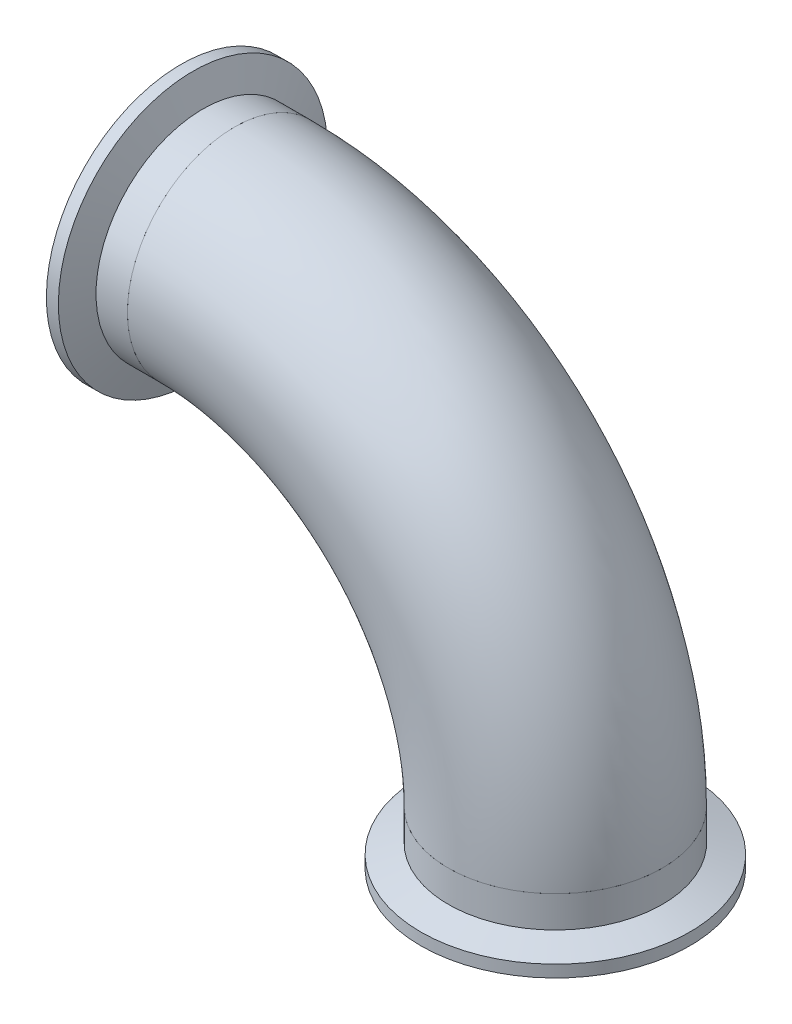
ISO-10303-21;
HEADER;
FILE_DESCRIPTION(('STEP AP214'),'2;1');
FILE_NAME('part.step','',(''),(''),'','','');
FILE_SCHEMA(('AUTOMOTIVE_DESIGN { 1 0 10303 214 1 1 1 1 }'));
ENDSEC;
DATA;
#1=APPLICATION_CONTEXT('core data for automotive mechanical design processes');
#2=APPLICATION_PROTOCOL_DEFINITION('international standard','automotive_design',2000,#1);
#3=PRODUCT_CONTEXT('',#1,'mechanical');
#4=PRODUCT('Part','Part','',(#3));
#5=PRODUCT_RELATED_PRODUCT_CATEGORY('part','',(#4));
#6=PRODUCT_DEFINITION_FORMATION('','',#4);
#7=PRODUCT_DEFINITION_CONTEXT('part definition',#1,'design');
#8=PRODUCT_DEFINITION('design','',#6,#7);
#9=PRODUCT_DEFINITION_SHAPE('','',#8);
#10=(LENGTH_UNIT() NAMED_UNIT(*) SI_UNIT(.MILLI.,.METRE.));
#11=(NAMED_UNIT(*) PLANE_ANGLE_UNIT() SI_UNIT($,.RADIAN.));
#12=(NAMED_UNIT(*) SI_UNIT($,.STERADIAN.) SOLID_ANGLE_UNIT());
#13=UNCERTAINTY_MEASURE_WITH_UNIT(LENGTH_MEASURE(1.E-05),#10,'distance_accuracy_value','');
#14=(GEOMETRIC_REPRESENTATION_CONTEXT(3) GLOBAL_UNCERTAINTY_ASSIGNED_CONTEXT((#13)) GLOBAL_UNIT_ASSIGNED_CONTEXT((#10,
#11,#12)) REPRESENTATION_CONTEXT('',''));
#15=CARTESIAN_POINT('',(0.,0.,0.));
#16=DIRECTION('',(0.,0.,1.));
#17=DIRECTION('',(1.,0.,0.));
#18=AXIS2_PLACEMENT_3D('',#15,#16,#17);
#19=CARTESIAN_POINT('',(-7.547417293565,109.721359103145,108.527403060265));
#20=DIRECTION('',(1.,0.,0.));
#21=DIRECTION('',(0.,-0.74812253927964,0.663560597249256));
#22=AXIS2_PLACEMENT_3D('',#19,#20,#21);
#23=PLANE('',#22);
#24=CARTESIAN_POINT('',(-7.547417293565,109.721359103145,108.527403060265));
#25=DIRECTION('',(-1.,0.,0.));
#26=DIRECTION('',(0.,0.74812253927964,-0.663560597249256));
#27=AXIS2_PLACEMENT_3D('',#24,#25,#26);
#28=CIRCLE('',#27,30.1591722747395);
#29=CARTESIAN_POINT('',(-7.54741729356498,132.284115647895,88.5149646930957));
#30=VERTEX_POINT('',#29);
#31=EDGE_CURVE('P0_E9',#30,#30,#28,.T.);
#32=ORIENTED_EDGE('',*,*,#31,.F.);
#33=EDGE_LOOP('',(#32));
#34=FACE_BOUND('',#33,.T.);
#35=CARTESIAN_POINT('',(-7.547417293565,109.721359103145,108.527403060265));
#36=DIRECTION('',(-1.,0.,0.));
#37=DIRECTION('',(0.,0.74812253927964,-0.663560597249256));
#38=AXIS2_PLACEMENT_3D('',#35,#36,#37);
#39=CIRCLE('',#38,31.9532);
#40=CARTESIAN_POINT('',(-7.54741729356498,133.626268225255,87.3245185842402));
#41=VERTEX_POINT('',#40);
#42=EDGE_CURVE('P0_E54',#41,#41,#39,.T.);
#43=ORIENTED_EDGE('',*,*,#42,.T.);
#44=EDGE_LOOP('',(#43));
#45=FACE_BOUND('',#44,.T.);
#46=ADVANCED_FACE('P0_F14',(#34,#45),#23,.F.);
#47=CARTESIAN_POINT('',(-6.760017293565,109.721359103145,108.527403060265));
#48=DIRECTION('',(-1.,0.,0.));
#49=DIRECTION('',(0.,0.74812253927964,-0.663560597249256));
#50=AXIS2_PLACEMENT_3D('',#47,#48,#49);
#51=TOROIDAL_SURFACE('',#50,30.1591722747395,0.7874);
#52=CARTESIAN_POINT('',(-7.06767898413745,109.721359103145,108.527403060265));
#53=DIRECTION('',(-1.,0.,0.));
#54=DIRECTION('',(0.,0.74812253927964,-0.663560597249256));
#55=AXIS2_PLACEMENT_3D('',#52,#53,#54);
#56=CIRCLE('',#55,29.4343667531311);
#57=CARTESIAN_POINT('',(-7.06767898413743,131.741872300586,88.9959170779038));
#58=VERTEX_POINT('',#57);
#59=EDGE_CURVE('P0_E20',#58,#58,#56,.T.);
#60=ORIENTED_EDGE('',*,*,#59,.F.);
#61=EDGE_LOOP('',(#60));
#62=FACE_BOUND('',#61,.T.);
#63=ORIENTED_EDGE('',*,*,#31,.T.);
#64=EDGE_LOOP('',(#63));
#65=FACE_BOUND('',#64,.T.);
#66=ADVANCED_FACE('P0_F96',(#62,#65),#51,.T.);
#67=CARTESIAN_POINT('',(-6.67456247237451,109.721359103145,108.527403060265));
#68=DIRECTION('',(-1.,0.,0.));
#69=DIRECTION('',(0.,0.74812253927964,-0.663560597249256));
#70=AXIS2_PLACEMENT_3D('',#67,#68,#69);
#71=CONICAL_SURFACE('',#70,29.2674986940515,0.401425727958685);
#72=ORIENTED_EDGE('',*,*,#59,.T.);
#73=EDGE_LOOP('',(#72));
#74=FACE_BOUND('',#73,.T.);
#75=CARTESIAN_POINT('',(-6.67456247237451,109.721359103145,108.527403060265));
#76=DIRECTION('',(-1.,0.,0.));
#77=DIRECTION('',(0.,0.74812253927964,-0.663560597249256));
#78=AXIS2_PLACEMENT_3D('',#75,#76,#77);
#79=CIRCLE('',#78,29.2674986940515);
#80=CARTESIAN_POINT('',(-6.67456247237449,131.617034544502,89.1066441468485));
#81=VERTEX_POINT('',#80);
#82=EDGE_CURVE('P0_E24',#81,#81,#79,.T.);
#83=ORIENTED_EDGE('',*,*,#82,.F.);
#84=EDGE_LOOP('',(#83));
#85=FACE_BOUND('',#84,.T.);
#86=ADVANCED_FACE('P0_F101',(#74,#85),#71,.F.);
#87=CARTESIAN_POINT('',(-7.14101729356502,109.721359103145,108.527403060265));
#88=DIRECTION('',(-1.,0.,0.));
#89=DIRECTION('',(0.,0.74812253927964,-0.663560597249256));
#90=AXIS2_PLACEMENT_3D('',#87,#88,#89);
#91=TOROIDAL_SURFACE('',#90,28.1686,1.1938);
#92=CARTESIAN_POINT('',(-6.67456247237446,109.721359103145,108.527403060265));
#93=DIRECTION('',(-1.,0.,0.));
#94=DIRECTION('',(0.,0.74812253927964,-0.663560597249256));
#95=AXIS2_PLACEMENT_3D('',#92,#93,#94);
#96=CIRCLE('',#95,27.0697013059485);
#97=CARTESIAN_POINT('',(-6.67456247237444,129.972812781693,90.565015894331));
#98=VERTEX_POINT('',#97);
#99=EDGE_CURVE('P0_E28',#98,#98,#96,.T.);
#100=ORIENTED_EDGE('',*,*,#99,.F.);
#101=EDGE_LOOP('',(#100));
#102=FACE_BOUND('',#101,.T.);
#103=ORIENTED_EDGE('',*,*,#82,.T.);
#104=EDGE_LOOP('',(#103));
#105=FACE_BOUND('',#104,.T.);
#106=ADVANCED_FACE('P0_F106',(#102,#105),#91,.F.);
#107=CARTESIAN_POINT('',(-6.67456247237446,109.721359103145,108.527403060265));
#108=DIRECTION('',(1.,0.,0.));
#109=DIRECTION('',(0.,-0.74812253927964,0.663560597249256));
#110=AXIS2_PLACEMENT_3D('',#107,#108,#109);
#111=CONICAL_SURFACE('',#110,27.0697013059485,0.401425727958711);
#112=CARTESIAN_POINT('',(-7.06767898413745,109.721359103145,108.527403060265));
#113=DIRECTION('',(-1.,0.,0.));
#114=DIRECTION('',(0.,0.74812253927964,-0.663560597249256));
#115=AXIS2_PLACEMENT_3D('',#112,#113,#114);
#116=CIRCLE('',#115,26.9028332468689);
#117=CARTESIAN_POINT('',(-7.06767898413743,129.847975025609,90.6757429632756));
#118=VERTEX_POINT('',#117);
#119=EDGE_CURVE('P0_E33',#118,#118,#116,.T.);
#120=ORIENTED_EDGE('',*,*,#119,.F.);
#121=EDGE_LOOP('',(#120));
#122=FACE_BOUND('',#121,.T.);
#123=ORIENTED_EDGE('',*,*,#99,.T.);
#124=EDGE_LOOP('',(#123));
#125=FACE_BOUND('',#124,.T.);
#126=ADVANCED_FACE('P0_F111',(#122,#125),#111,.T.);
#127=CARTESIAN_POINT('',(-6.760017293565,109.721359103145,108.527403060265));
#128=DIRECTION('',(-1.,0.,0.));
#129=DIRECTION('',(0.,0.74812253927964,-0.663560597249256));
#130=AXIS2_PLACEMENT_3D('',#127,#128,#129);
#131=TOROIDAL_SURFACE('',#130,26.1780277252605,0.787399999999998);
#132=ORIENTED_EDGE('',*,*,#119,.T.);
#133=EDGE_LOOP('',(#132));
#134=FACE_BOUND('',#133,.T.);
#135=CARTESIAN_POINT('',(-7.547417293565,109.721359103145,108.527403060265));
#136=DIRECTION('',(-1.,0.,0.));
#137=DIRECTION('',(0.,0.74812253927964,-0.663560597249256));
#138=AXIS2_PLACEMENT_3D('',#135,#136,#137);
#139=CIRCLE('',#138,26.1780277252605);
#140=CARTESIAN_POINT('',(-7.54741729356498,129.3057316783,91.1566953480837));
#141=VERTEX_POINT('',#140);
#142=EDGE_CURVE('P0_E36',#141,#141,#139,.T.);
#143=ORIENTED_EDGE('',*,*,#142,.F.);
#144=EDGE_LOOP('',(#143));
#145=FACE_BOUND('',#144,.T.);
#146=ADVANCED_FACE('P0_F92',(#134,#145),#131,.T.);
#147=CARTESIAN_POINT('',(-7.547417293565,109.721359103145,108.527403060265));
#148=DIRECTION('',(1.,0.,0.));
#149=DIRECTION('',(0.,-0.74812253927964,0.663560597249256));
#150=AXIS2_PLACEMENT_3D('',#147,#148,#149);
#151=PLANE('',#150);
#152=CARTESIAN_POINT('',(-7.547417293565,109.721359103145,108.527403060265));
#153=DIRECTION('',(-1.,0.,0.));
#154=DIRECTION('',(0.,0.74812253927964,-0.663560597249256));
#155=AXIS2_PLACEMENT_3D('',#152,#153,#154);
#156=CIRCLE('',#155,23.749);
#157=CARTESIAN_POINT('',(-7.54741729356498,127.488521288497,92.7685024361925));
#158=VERTEX_POINT('',#157);
#159=EDGE_CURVE('P0_E39',#158,#158,#156,.T.);
#160=ORIENTED_EDGE('',*,*,#159,.F.);
#161=EDGE_LOOP('',(#160));
#162=FACE_BOUND('',#161,.T.);
#163=ORIENTED_EDGE('',*,*,#142,.T.);
#164=EDGE_LOOP('',(#163));
#165=FACE_BOUND('',#164,.T.);
#166=ADVANCED_FACE('P0_F85',(#162,#165),#151,.F.);
#167=CARTESIAN_POINT('',(-7.547417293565,109.721359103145,108.527403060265));
#168=DIRECTION('',(-1.,0.,0.));
#169=DIRECTION('',(0.,0.74812253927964,-0.663560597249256));
#170=AXIS2_PLACEMENT_3D('',#167,#168,#169);
#171=CYLINDRICAL_SURFACE('',#170,23.749);
#172=ORIENTED_EDGE('',*,*,#159,.T.);
#173=EDGE_LOOP('',(#172));
#174=FACE_BOUND('',#173,.T.);
#175=CARTESIAN_POINT('',(5.15258270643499,109.721359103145,108.527403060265));
#176=DIRECTION('',(-1.,0.,0.));
#177=DIRECTION('',(0.,0.74812253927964,-0.663560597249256));
#178=AXIS2_PLACEMENT_3D('',#175,#176,#177);
#179=CIRCLE('',#178,23.749);
#180=CARTESIAN_POINT('',(5.15258270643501,127.488521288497,92.7685024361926));
#181=VERTEX_POINT('',#180);
#182=EDGE_CURVE('P0_E42',#181,#181,#179,.T.);
#183=ORIENTED_EDGE('',*,*,#182,.F.);
#184=EDGE_LOOP('',(#183));
#185=FACE_BOUND('',#184,.T.);
#186=ADVANCED_FACE('P0_F80',(#174,#185),#171,.F.);
#187=CARTESIAN_POINT('',(5.15258270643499,109.721359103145,108.527403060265));
#188=DIRECTION('',(-1.,0.,0.));
#189=DIRECTION('',(0.,0.74812253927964,-0.663560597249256));
#190=AXIS2_PLACEMENT_3D('',#187,#188,#189);
#191=PLANE('',#190);
#192=CARTESIAN_POINT('',(5.15258270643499,109.721359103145,108.527403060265));
#193=DIRECTION('',(-1.,0.,0.));
#194=DIRECTION('',(0.,0.74812253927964,-0.663560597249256));
#195=AXIS2_PLACEMENT_3D('',#192,#193,#194);
#196=CIRCLE('',#195,25.4);
#197=CARTESIAN_POINT('',(5.15258270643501,128.723671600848,91.6729638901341));
#198=VERTEX_POINT('',#197);
#199=EDGE_CURVE('P0_E45',#198,#198,#196,.T.);
#200=ORIENTED_EDGE('',*,*,#199,.F.);
#201=EDGE_LOOP('',(#200));
#202=FACE_BOUND('',#201,.T.);
#203=ORIENTED_EDGE('',*,*,#182,.T.);
#204=EDGE_LOOP('',(#203));
#205=FACE_BOUND('',#204,.T.);
#206=ADVANCED_FACE('P0_F74',(#202,#205),#191,.F.);
#207=CARTESIAN_POINT('',(-7.547417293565,109.721359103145,108.527403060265));
#208=DIRECTION('',(-1.,0.,0.));
#209=DIRECTION('',(0.,0.74812253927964,-0.663560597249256));
#210=AXIS2_PLACEMENT_3D('',#207,#208,#209);
#211=CYLINDRICAL_SURFACE('',#210,25.4);
#212=CARTESIAN_POINT('',(-2.31744755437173,109.721359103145,108.527403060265));
#213=DIRECTION('',(-1.,0.,0.));
#214=DIRECTION('',(0.,0.74812253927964,-0.663560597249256));
#215=AXIS2_PLACEMENT_3D('',#212,#213,#214);
#216=CIRCLE('',#215,25.4);
#217=CARTESIAN_POINT('',(-2.31744755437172,128.723671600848,91.6729638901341));
#218=VERTEX_POINT('',#217);
#219=EDGE_CURVE('P0_E48',#218,#218,#216,.T.);
#220=ORIENTED_EDGE('',*,*,#219,.F.);
#221=EDGE_LOOP('',(#220));
#222=FACE_BOUND('',#221,.T.);
#223=ORIENTED_EDGE('',*,*,#199,.T.);
#224=EDGE_LOOP('',(#223));
#225=FACE_BOUND('',#224,.T.);
#226=ADVANCED_FACE('P0_F68',(#222,#225),#211,.T.);
#227=CARTESIAN_POINT('',(-2.31744755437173,109.721359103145,108.527403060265));
#228=DIRECTION('',(-1.,0.,0.));
#229=DIRECTION('',(0.,0.74812253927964,-0.663560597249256));
#230=AXIS2_PLACEMENT_3D('',#227,#228,#229);
#231=CONICAL_SURFACE('',#230,25.4,1.22173047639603);
#232=CARTESIAN_POINT('',(-4.70261729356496,109.721359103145,108.527403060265));
#233=DIRECTION('',(-1.,0.,0.));
#234=DIRECTION('',(0.,0.74812253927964,-0.663560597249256));
#235=AXIS2_PLACEMENT_3D('',#232,#233,#234);
#236=CIRCLE('',#235,31.9532);
#237=CARTESIAN_POINT('',(-4.70261729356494,133.626268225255,87.3245185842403));
#238=VERTEX_POINT('',#237);
#239=EDGE_CURVE('P0_E51',#238,#238,#236,.T.);
#240=ORIENTED_EDGE('',*,*,#239,.F.);
#241=EDGE_LOOP('',(#240));
#242=FACE_BOUND('',#241,.T.);
#243=ORIENTED_EDGE('',*,*,#219,.T.);
#244=EDGE_LOOP('',(#243));
#245=FACE_BOUND('',#244,.T.);
#246=ADVANCED_FACE('P0_F62',(#242,#245),#231,.T.);
#247=CARTESIAN_POINT('',(-7.547417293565,109.721359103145,108.527403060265));
#248=DIRECTION('',(-1.,0.,0.));
#249=DIRECTION('',(0.,0.74812253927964,-0.663560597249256));
#250=AXIS2_PLACEMENT_3D('',#247,#248,#249);
#251=CYLINDRICAL_SURFACE('',#250,31.9532);
#252=ORIENTED_EDGE('',*,*,#42,.F.);
#253=EDGE_LOOP('',(#252));
#254=FACE_BOUND('',#253,.T.);
#255=ORIENTED_EDGE('',*,*,#239,.T.);
#256=EDGE_LOOP('',(#255));
#257=FACE_BOUND('',#256,.T.);
#258=ADVANCED_FACE('P0_F59',(#254,#257),#251,.T.);
#259=CLOSED_SHELL('',(#46,#66,#86,#106,#126,#146,#166,#186,#206,#226,#246,#258));
#260=MANIFOLD_SOLID_BREP('P0_B1',#259);
#261=CARTESIAN_POINT('',(81.3525827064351,20.8213591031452,108.527403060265));
#262=DIRECTION('',(0.,1.,0.));
#263=DIRECTION('',(0.,0.,1.));
#264=AXIS2_PLACEMENT_3D('',#261,#262,#263);
#265=PLANE('',#264);
#266=CARTESIAN_POINT('',(81.3525827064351,20.8213591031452,108.527403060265));
#267=DIRECTION('',(0.,-1.,0.));
#268=DIRECTION('',(0.,0.,-1.));
#269=AXIS2_PLACEMENT_3D('',#266,#267,#268);
#270=CIRCLE('',#269,30.1591722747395);
#271=CARTESIAN_POINT('',(81.3525827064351,20.8213591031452,78.3682307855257));
#272=VERTEX_POINT('',#271);
#273=EDGE_CURVE('P1_E10',#272,#272,#270,.T.);
#274=ORIENTED_EDGE('',*,*,#273,.F.);
#275=EDGE_LOOP('',(#274));
#276=FACE_BOUND('',#275,.T.);
#277=CARTESIAN_POINT('',(81.3525827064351,20.8213591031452,108.527403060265));
#278=DIRECTION('',(0.,-1.,0.));
#279=DIRECTION('',(0.,0.,-1.));
#280=AXIS2_PLACEMENT_3D('',#277,#278,#279);
#281=CIRCLE('',#280,31.9532);
#282=CARTESIAN_POINT('',(81.3525827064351,20.8213591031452,76.5742030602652));
#283=VERTEX_POINT('',#282);
#284=EDGE_CURVE('P1_E55',#283,#283,#281,.T.);
#285=ORIENTED_EDGE('',*,*,#284,.T.);
#286=EDGE_LOOP('',(#285));
#287=FACE_BOUND('',#286,.T.);
#288=ADVANCED_FACE('P1_F15',(#276,#287),#265,.F.);
#289=CARTESIAN_POINT('',(81.3525827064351,21.6087591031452,108.527403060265));
#290=DIRECTION('',(0.,-1.,0.));
#291=DIRECTION('',(0.,0.,-1.));
#292=AXIS2_PLACEMENT_3D('',#289,#290,#291);
#293=TOROIDAL_SURFACE('',#292,30.1591722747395,0.7874);
#294=CARTESIAN_POINT('',(81.3525827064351,21.3010974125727,108.527403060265));
#295=DIRECTION('',(0.,-1.,0.));
#296=DIRECTION('',(0.,0.,-1.));
#297=AXIS2_PLACEMENT_3D('',#294,#295,#296);
#298=CIRCLE('',#297,29.4343667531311);
#299=CARTESIAN_POINT('',(81.3525827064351,21.3010974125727,79.0930363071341));
#300=VERTEX_POINT('',#299);
#301=EDGE_CURVE('P1_E21',#300,#300,#298,.T.);
#302=ORIENTED_EDGE('',*,*,#301,.F.);
#303=EDGE_LOOP('',(#302));
#304=FACE_BOUND('',#303,.T.);
#305=ORIENTED_EDGE('',*,*,#273,.T.);
#306=EDGE_LOOP('',(#305));
#307=FACE_BOUND('',#306,.T.);
#308=ADVANCED_FACE('P1_F97',(#304,#307),#293,.T.);
#309=CARTESIAN_POINT('',(81.3525827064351,21.6942139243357,108.527403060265));
#310=DIRECTION('',(0.,-1.,0.));
#311=DIRECTION('',(0.,0.,-1.));
#312=AXIS2_PLACEMENT_3D('',#309,#310,#311);
#313=CONICAL_SURFACE('',#312,29.2674986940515,0.401425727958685);
#314=ORIENTED_EDGE('',*,*,#301,.T.);
#315=EDGE_LOOP('',(#314));
#316=FACE_BOUND('',#315,.T.);
#317=CARTESIAN_POINT('',(81.3525827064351,21.6942139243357,108.527403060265));
#318=DIRECTION('',(0.,-1.,0.));
#319=DIRECTION('',(0.,0.,-1.));
#320=AXIS2_PLACEMENT_3D('',#317,#318,#319);
#321=CIRCLE('',#320,29.2674986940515);
#322=CARTESIAN_POINT('',(81.3525827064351,21.6942139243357,79.2599043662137));
#323=VERTEX_POINT('',#322);
#324=EDGE_CURVE('P1_E25',#323,#323,#321,.T.);
#325=ORIENTED_EDGE('',*,*,#324,.F.);
#326=EDGE_LOOP('',(#325));
#327=FACE_BOUND('',#326,.T.);
#328=ADVANCED_FACE('P1_F102',(#316,#327),#313,.F.);
#329=CARTESIAN_POINT('',(81.3525827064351,21.2277591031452,108.527403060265));
#330=DIRECTION('',(0.,-1.,0.));
#331=DIRECTION('',(0.,0.,-1.));
#332=AXIS2_PLACEMENT_3D('',#329,#330,#331);
#333=TOROIDAL_SURFACE('',#332,28.1686,1.1938);
#334=CARTESIAN_POINT('',(81.3525827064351,21.6942139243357,108.527403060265));
#335=DIRECTION('',(0.,-1.,0.));
#336=DIRECTION('',(0.,0.,-1.));
#337=AXIS2_PLACEMENT_3D('',#334,#335,#336);
#338=CIRCLE('',#337,27.0697013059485);
#339=CARTESIAN_POINT('',(81.3525827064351,21.6942139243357,81.4577017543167));
#340=VERTEX_POINT('',#339);
#341=EDGE_CURVE('P1_E29',#340,#340,#338,.T.);
#342=ORIENTED_EDGE('',*,*,#341,.F.);
#343=EDGE_LOOP('',(#342));
#344=FACE_BOUND('',#343,.T.);
#345=ORIENTED_EDGE('',*,*,#324,.T.);
#346=EDGE_LOOP('',(#345));
#347=FACE_BOUND('',#346,.T.);
#348=ADVANCED_FACE('P1_F107',(#344,#347),#333,.F.);
#349=CARTESIAN_POINT('',(81.3525827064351,21.6942139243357,108.527403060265));
#350=DIRECTION('',(0.,1.,0.));
#351=DIRECTION('',(0.,0.,1.));
#352=AXIS2_PLACEMENT_3D('',#349,#350,#351);
#353=CONICAL_SURFACE('',#352,27.0697013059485,0.401425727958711);
#354=CARTESIAN_POINT('',(81.3525827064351,21.3010974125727,108.527403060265));
#355=DIRECTION('',(0.,-1.,0.));
#356=DIRECTION('',(0.,0.,-1.));
#357=AXIS2_PLACEMENT_3D('',#354,#355,#356);
#358=CIRCLE('',#357,26.9028332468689);
#359=CARTESIAN_POINT('',(81.3525827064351,21.3010974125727,81.6245698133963));
#360=VERTEX_POINT('',#359);
#361=EDGE_CURVE('P1_E34',#360,#360,#358,.T.);
#362=ORIENTED_EDGE('',*,*,#361,.F.);
#363=EDGE_LOOP('',(#362));
#364=FACE_BOUND('',#363,.T.);
#365=ORIENTED_EDGE('',*,*,#341,.T.);
#366=EDGE_LOOP('',(#365));
#367=FACE_BOUND('',#366,.T.);
#368=ADVANCED_FACE('P1_F112',(#364,#367),#353,.T.);
#369=CARTESIAN_POINT('',(81.3525827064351,21.6087591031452,108.527403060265));
#370=DIRECTION('',(0.,-1.,0.));
#371=DIRECTION('',(0.,0.,-1.));
#372=AXIS2_PLACEMENT_3D('',#369,#370,#371);
#373=TOROIDAL_SURFACE('',#372,26.1780277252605,0.787399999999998);
#374=ORIENTED_EDGE('',*,*,#361,.T.);
#375=EDGE_LOOP('',(#374));
#376=FACE_BOUND('',#375,.T.);
#377=CARTESIAN_POINT('',(81.3525827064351,20.8213591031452,108.527403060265));
#378=DIRECTION('',(0.,-1.,0.));
#379=DIRECTION('',(0.,0.,-1.));
#380=AXIS2_PLACEMENT_3D('',#377,#378,#379);
#381=CIRCLE('',#380,26.1780277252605);
#382=CARTESIAN_POINT('',(81.3525827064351,20.8213591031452,82.3493753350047));
#383=VERTEX_POINT('',#382);
#384=EDGE_CURVE('P1_E37',#383,#383,#381,.T.);
#385=ORIENTED_EDGE('',*,*,#384,.F.);
#386=EDGE_LOOP('',(#385));
#387=FACE_BOUND('',#386,.T.);
#388=ADVANCED_FACE('P1_F93',(#376,#387),#373,.T.);
#389=CARTESIAN_POINT('',(81.3525827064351,20.8213591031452,108.527403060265));
#390=DIRECTION('',(0.,1.,0.));
#391=DIRECTION('',(0.,0.,1.));
#392=AXIS2_PLACEMENT_3D('',#389,#390,#391);
#393=PLANE('',#392);
#394=CARTESIAN_POINT('',(81.3525827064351,20.8213591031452,108.527403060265));
#395=DIRECTION('',(0.,-1.,0.));
#396=DIRECTION('',(0.,0.,-1.));
#397=AXIS2_PLACEMENT_3D('',#394,#395,#396);
#398=CIRCLE('',#397,23.749);
#399=CARTESIAN_POINT('',(81.3525827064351,20.8213591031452,84.7784030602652));
#400=VERTEX_POINT('',#399);
#401=EDGE_CURVE('P1_E40',#400,#400,#398,.T.);
#402=ORIENTED_EDGE('',*,*,#401,.F.);
#403=EDGE_LOOP('',(#402));
#404=FACE_BOUND('',#403,.T.);
#405=ORIENTED_EDGE('',*,*,#384,.T.);
#406=EDGE_LOOP('',(#405));
#407=FACE_BOUND('',#406,.T.);
#408=ADVANCED_FACE('P1_F86',(#404,#407),#393,.F.);
#409=CARTESIAN_POINT('',(81.3525827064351,20.8213591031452,108.527403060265));
#410=DIRECTION('',(0.,-1.,0.));
#411=DIRECTION('',(0.,0.,-1.));
#412=AXIS2_PLACEMENT_3D('',#409,#410,#411);
#413=CYLINDRICAL_SURFACE('',#412,23.749);
#414=ORIENTED_EDGE('',*,*,#401,.T.);
#415=EDGE_LOOP('',(#414));
#416=FACE_BOUND('',#415,.T.);
#417=CARTESIAN_POINT('',(81.352582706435,33.5213591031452,108.527403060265));
#418=DIRECTION('',(0.,-1.,0.));
#419=DIRECTION('',(0.,0.,-1.));
#420=AXIS2_PLACEMENT_3D('',#417,#418,#419);
#421=CIRCLE('',#420,23.749);
#422=CARTESIAN_POINT('',(81.352582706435,33.5213591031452,84.7784030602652));
#423=VERTEX_POINT('',#422);
#424=EDGE_CURVE('P1_E43',#423,#423,#421,.T.);
#425=ORIENTED_EDGE('',*,*,#424,.F.);
#426=EDGE_LOOP('',(#425));
#427=FACE_BOUND('',#426,.T.);
#428=ADVANCED_FACE('P1_F81',(#416,#427),#413,.F.);
#429=CARTESIAN_POINT('',(81.352582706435,33.5213591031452,108.527403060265));
#430=DIRECTION('',(0.,-1.,0.));
#431=DIRECTION('',(0.,0.,-1.));
#432=AXIS2_PLACEMENT_3D('',#429,#430,#431);
#433=PLANE('',#432);
#434=CARTESIAN_POINT('',(81.352582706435,33.5213591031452,108.527403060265));
#435=DIRECTION('',(0.,-1.,0.));
#436=DIRECTION('',(0.,0.,-1.));
#437=AXIS2_PLACEMENT_3D('',#434,#435,#436);
#438=CIRCLE('',#437,25.4);
#439=CARTESIAN_POINT('',(81.352582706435,33.5213591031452,83.1274030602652));
#440=VERTEX_POINT('',#439);
#441=EDGE_CURVE('P1_E46',#440,#440,#438,.T.);
#442=ORIENTED_EDGE('',*,*,#441,.F.);
#443=EDGE_LOOP('',(#442));
#444=FACE_BOUND('',#443,.T.);
#445=ORIENTED_EDGE('',*,*,#424,.T.);
#446=EDGE_LOOP('',(#445));
#447=FACE_BOUND('',#446,.T.);
#448=ADVANCED_FACE('P1_F75',(#444,#447),#433,.F.);
#449=CARTESIAN_POINT('',(81.3525827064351,20.8213591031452,108.527403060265));
#450=DIRECTION('',(0.,-1.,0.));
#451=DIRECTION('',(0.,0.,-1.));
#452=AXIS2_PLACEMENT_3D('',#449,#450,#451);
#453=CYLINDRICAL_SURFACE('',#452,25.4);
#454=CARTESIAN_POINT('',(81.352582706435,26.0513288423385,108.527403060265));
#455=DIRECTION('',(0.,-1.,0.));
#456=DIRECTION('',(0.,0.,-1.));
#457=AXIS2_PLACEMENT_3D('',#454,#455,#456);
#458=CIRCLE('',#457,25.4);
#459=CARTESIAN_POINT('',(81.3525827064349,26.0513288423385,83.1274030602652));
#460=VERTEX_POINT('',#459);
#461=EDGE_CURVE('P1_E49',#460,#460,#458,.T.);
#462=ORIENTED_EDGE('',*,*,#461,.F.);
#463=EDGE_LOOP('',(#462));
#464=FACE_BOUND('',#463,.T.);
#465=ORIENTED_EDGE('',*,*,#441,.T.);
#466=EDGE_LOOP('',(#465));
#467=FACE_BOUND('',#466,.T.);
#468=ADVANCED_FACE('P1_F69',(#464,#467),#453,.T.);
#469=CARTESIAN_POINT('',(81.352582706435,26.0513288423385,108.527403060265));
#470=DIRECTION('',(0.,-1.,0.));
#471=DIRECTION('',(0.,0.,-1.));
#472=AXIS2_PLACEMENT_3D('',#469,#470,#471);
#473=CONICAL_SURFACE('',#472,25.4,1.22173047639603);
#474=CARTESIAN_POINT('',(81.352582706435,23.6661591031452,108.527403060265));
#475=DIRECTION('',(0.,-1.,0.));
#476=DIRECTION('',(0.,0.,-1.));
#477=AXIS2_PLACEMENT_3D('',#474,#475,#476);
#478=CIRCLE('',#477,31.9532);
#479=CARTESIAN_POINT('',(81.352582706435,23.6661591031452,76.5742030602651));
#480=VERTEX_POINT('',#479);
#481=EDGE_CURVE('P1_E52',#480,#480,#478,.T.);
#482=ORIENTED_EDGE('',*,*,#481,.F.);
#483=EDGE_LOOP('',(#482));
#484=FACE_BOUND('',#483,.T.);
#485=ORIENTED_EDGE('',*,*,#461,.T.);
#486=EDGE_LOOP('',(#485));
#487=FACE_BOUND('',#486,.T.);
#488=ADVANCED_FACE('P1_F63',(#484,#487),#473,.T.);
#489=CARTESIAN_POINT('',(81.3525827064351,20.8213591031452,108.527403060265));
#490=DIRECTION('',(0.,-1.,0.));
#491=DIRECTION('',(0.,0.,-1.));
#492=AXIS2_PLACEMENT_3D('',#489,#490,#491);
#493=CYLINDRICAL_SURFACE('',#492,31.9532);
#494=ORIENTED_EDGE('',*,*,#284,.F.);
#495=EDGE_LOOP('',(#494));
#496=FACE_BOUND('',#495,.T.);
#497=ORIENTED_EDGE('',*,*,#481,.T.);
#498=EDGE_LOOP('',(#497));
#499=FACE_BOUND('',#498,.T.);
#500=ADVANCED_FACE('P1_F60',(#496,#499),#493,.T.);
#501=CLOSED_SHELL('',(#288,#308,#328,#348,#368,#388,#408,#428,#448,#468,#488,#500));
#502=MANIFOLD_SOLID_BREP('P1_B1',#501);
#503=CARTESIAN_POINT('',(5.15258270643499,33.5213591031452,108.527403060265));
#504=DIRECTION('',(0.,0.,-1.));
#505=DIRECTION('',(-1.,0.,0.));
#506=AXIS2_PLACEMENT_3D('',#503,#504,#505);
#507=TOROIDAL_SURFACE('',#506,76.2,25.4);
#508=CARTESIAN_POINT('',(5.15258270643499,109.721359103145,108.527403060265));
#509=DIRECTION('',(-1.,0.,0.));
#510=DIRECTION('',(0.,0.,1.));
#511=AXIS2_PLACEMENT_3D('',#508,#509,#510);
#512=CIRCLE('',#511,25.4);
#513=CARTESIAN_POINT('',(5.152582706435,135.121359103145,108.527403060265));
#514=VERTEX_POINT('',#513);
#515=EDGE_CURVE('P2_E10',#514,#514,#512,.T.);
#516=CARTESIAN_POINT('',(81.352582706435,33.5213591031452,108.527403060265));
#517=DIRECTION('',(0.,1.,0.));
#518=DIRECTION('',(0.,0.,1.));
#519=AXIS2_PLACEMENT_3D('',#516,#517,#518);
#520=CIRCLE('',#519,25.4);
#521=CARTESIAN_POINT('',(106.752582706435,33.5213591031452,108.527403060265));
#522=VERTEX_POINT('',#521);
#523=EDGE_CURVE('P2_E21',#522,#522,#520,.T.);
#524=CARTESIAN_POINT('',(5.15258270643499,33.5213591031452,108.527403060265));
#525=DIRECTION('',(0.,0.,-1.));
#526=DIRECTION('',(-1.,0.,0.));
#527=AXIS2_PLACEMENT_3D('',#524,#525,#526);
#528=CIRCLE('',#527,101.6);
#529=EDGE_CURVE('',#514,#522,#528,.T.);
#530=ORIENTED_EDGE('',*,*,#515,.F.);
#531=ORIENTED_EDGE('',*,*,#523,.T.);
#532=ORIENTED_EDGE('',*,*,#529,.T.);
#533=ORIENTED_EDGE('',*,*,#529,.F.);
#534=EDGE_LOOP('',(#530,#532,#531,#533));
#535=FACE_BOUND('',#534,.T.);
#536=ADVANCED_FACE('P2_F15',(#535),#507,.T.);
#537=CARTESIAN_POINT('',(5.15258270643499,109.721359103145,108.527403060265));
#538=DIRECTION('',(-1.,0.,0.));
#539=DIRECTION('',(0.,0.,1.));
#540=AXIS2_PLACEMENT_3D('',#537,#538,#539);
#541=PLANE('',#540);
#542=CARTESIAN_POINT('',(5.15258270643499,109.721359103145,108.527403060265));
#543=DIRECTION('',(-1.,0.,0.));
#544=DIRECTION('',(0.,-1.,0.));
#545=AXIS2_PLACEMENT_3D('',#542,#543,#544);
#546=CIRCLE('',#545,23.749);
#547=CARTESIAN_POINT('',(5.152582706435,133.470359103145,108.527403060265));
#548=VERTEX_POINT('',#547);
#549=EDGE_CURVE('P2_E25',#548,#548,#546,.T.);
#550=ORIENTED_EDGE('',*,*,#549,.F.);
#551=EDGE_LOOP('',(#550));
#552=FACE_BOUND('',#551,.T.);
#553=ORIENTED_EDGE('',*,*,#515,.T.);
#554=EDGE_LOOP('',(#553));
#555=FACE_BOUND('',#554,.T.);
#556=ADVANCED_FACE('P2_F46',(#552,#555),#541,.T.);
#557=CARTESIAN_POINT('',(81.352582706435,33.5213591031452,108.527403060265));
#558=DIRECTION('',(0.,1.,0.));
#559=DIRECTION('',(0.,0.,1.));
#560=AXIS2_PLACEMENT_3D('',#557,#558,#559);
#561=PLANE('',#560);
#562=CARTESIAN_POINT('',(81.352582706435,33.5213591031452,108.527403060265));
#563=DIRECTION('',(0.,1.,0.));
#564=DIRECTION('',(0.,0.,1.));
#565=AXIS2_PLACEMENT_3D('',#562,#563,#564);
#566=CIRCLE('',#565,23.749);
#567=CARTESIAN_POINT('',(105.101582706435,33.5213591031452,108.527403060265));
#568=VERTEX_POINT('',#567);
#569=EDGE_CURVE('P2_E29',#568,#568,#566,.T.);
#570=ORIENTED_EDGE('',*,*,#569,.T.);
#571=EDGE_LOOP('',(#570));
#572=FACE_BOUND('',#571,.T.);
#573=ORIENTED_EDGE('',*,*,#523,.F.);
#574=EDGE_LOOP('',(#573));
#575=FACE_BOUND('',#574,.T.);
#576=ADVANCED_FACE('P2_F35',(#572,#575),#561,.F.);
#577=CARTESIAN_POINT('',(5.15258270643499,33.5213591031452,108.527403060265));
#578=DIRECTION('',(0.,0.,-1.));
#579=DIRECTION('',(-1.,0.,0.));
#580=AXIS2_PLACEMENT_3D('',#577,#578,#579);
#581=TOROIDAL_SURFACE('',#580,76.2,23.749);
#582=CARTESIAN_POINT('',(5.15258270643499,33.5213591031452,108.527403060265));
#583=DIRECTION('',(0.,0.,-1.));
#584=DIRECTION('',(-1.,0.,0.));
#585=AXIS2_PLACEMENT_3D('',#582,#583,#584);
#586=CIRCLE('',#585,99.949);
#587=EDGE_CURVE('',#548,#568,#586,.T.);
#588=ORIENTED_EDGE('',*,*,#549,.T.);
#589=ORIENTED_EDGE('',*,*,#569,.F.);
#590=ORIENTED_EDGE('',*,*,#587,.T.);
#591=ORIENTED_EDGE('',*,*,#587,.F.);
#592=EDGE_LOOP('',(#588,#590,#589,#591));
#593=FACE_BOUND('',#592,.T.);
#594=ADVANCED_FACE('P2_F38',(#593),#581,.F.);
#595=CLOSED_SHELL('',(#536,#556,#576,#594));
#596=MANIFOLD_SOLID_BREP('P2_B1',#595);
#597=ADVANCED_BREP_SHAPE_REPRESENTATION('',(#18,#260,#502,#596),#14);
#598=SHAPE_DEFINITION_REPRESENTATION(#9,#597);
ENDSEC;
END-ISO-10303-21;
